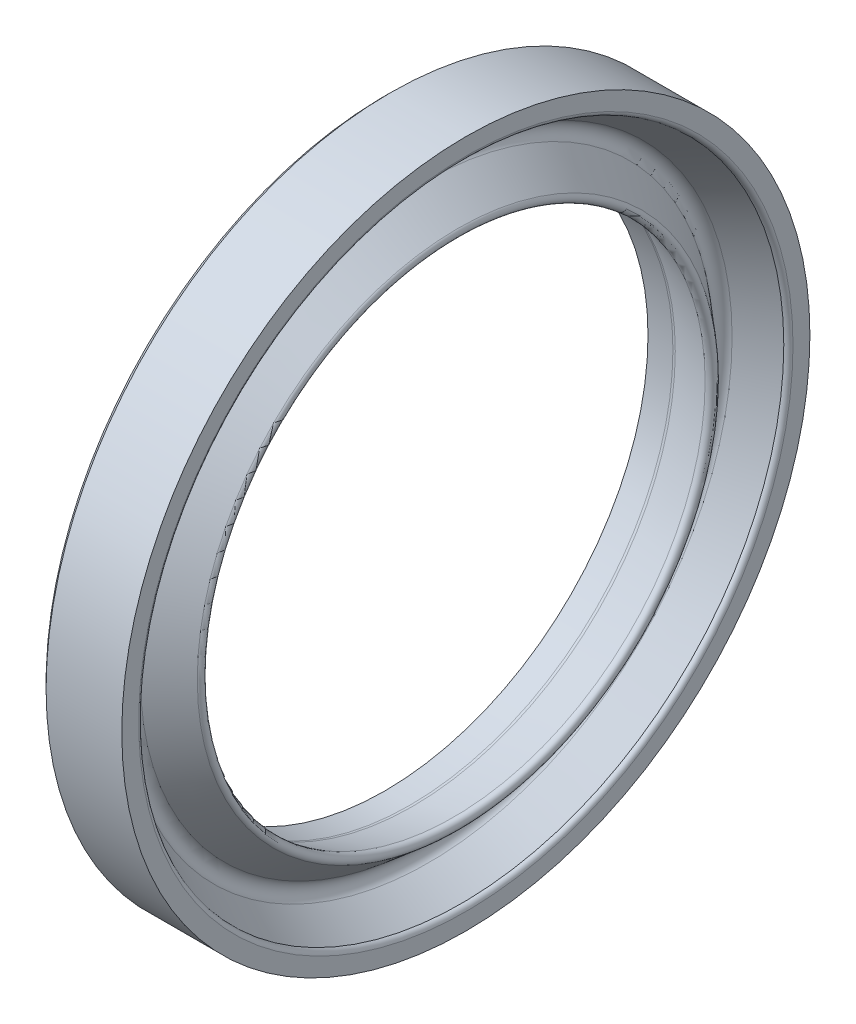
ISO-10303-21;
HEADER;
FILE_DESCRIPTION(('STEP AP214'),'2;1');
FILE_NAME('part.step','',(''),(''),'','','');
FILE_SCHEMA(('AUTOMOTIVE_DESIGN { 1 0 10303 214 1 1 1 1 }'));
ENDSEC;
DATA;
#1=APPLICATION_CONTEXT('core data for automotive mechanical design processes');
#2=APPLICATION_PROTOCOL_DEFINITION('international standard','automotive_design',2000,#1);
#3=PRODUCT_CONTEXT('',#1,'mechanical');
#4=PRODUCT('Part','Part','',(#3));
#5=PRODUCT_RELATED_PRODUCT_CATEGORY('part','',(#4));
#6=PRODUCT_DEFINITION_FORMATION('','',#4);
#7=PRODUCT_DEFINITION_CONTEXT('part definition',#1,'design');
#8=PRODUCT_DEFINITION('design','',#6,#7);
#9=PRODUCT_DEFINITION_SHAPE('','',#8);
#10=(LENGTH_UNIT() NAMED_UNIT(*) SI_UNIT(.MILLI.,.METRE.));
#11=(NAMED_UNIT(*) PLANE_ANGLE_UNIT() SI_UNIT($,.RADIAN.));
#12=(NAMED_UNIT(*) SI_UNIT($,.STERADIAN.) SOLID_ANGLE_UNIT());
#13=UNCERTAINTY_MEASURE_WITH_UNIT(LENGTH_MEASURE(1.E-05),#10,'distance_accuracy_value','');
#14=(GEOMETRIC_REPRESENTATION_CONTEXT(3) GLOBAL_UNCERTAINTY_ASSIGNED_CONTEXT((#13)) GLOBAL_UNIT_ASSIGNED_CONTEXT((#10,
#11,#12)) REPRESENTATION_CONTEXT('',''));
#15=CARTESIAN_POINT('',(0.,0.,0.));
#16=DIRECTION('',(0.,0.,1.));
#17=DIRECTION('',(1.,0.,0.));
#18=AXIS2_PLACEMENT_3D('',#15,#16,#17);
#19=CARTESIAN_POINT('',(-0.394634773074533,0.,0.));
#20=DIRECTION('',(1.,0.,0.));
#21=DIRECTION('',(0.,0.,-1.));
#22=AXIS2_PLACEMENT_3D('',#19,#20,#21);
#23=TOROIDAL_SURFACE('',#22,40.4953832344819,0.649999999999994);
#24=CARTESIAN_POINT('',(-0.324999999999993,0.,0.));
#25=DIRECTION('',(1.,0.,0.));
#26=DIRECTION('',(0.,0.,-1.));
#27=AXIS2_PLACEMENT_3D('',#24,#25,#26);
#28=CIRCLE('',#27,39.8491239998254);
#29=CARTESIAN_POINT('',(-0.324999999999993,0.,-39.8491239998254));
#30=VERTEX_POINT('',#29);
#31=EDGE_CURVE('E10',#30,#30,#28,.T.);
#32=ORIENTED_EDGE('',*,*,#31,.F.);
#33=EDGE_LOOP('',(#32));
#34=FACE_BOUND('',#33,.T.);
#35=CARTESIAN_POINT('',(0.249999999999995,0.,0.));
#36=DIRECTION('',(1.,0.,0.));
#37=DIRECTION('',(0.,0.,-1.));
#38=AXIS2_PLACEMENT_3D('',#35,#36,#37);
#39=CIRCLE('',#38,40.4120405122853);
#40=CARTESIAN_POINT('',(0.249999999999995,0.,-40.4120405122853));
#41=VERTEX_POINT('',#40);
#42=EDGE_CURVE('E70',#41,#41,#39,.T.);
#43=ORIENTED_EDGE('',*,*,#42,.T.);
#44=EDGE_LOOP('',(#43));
#45=FACE_BOUND('',#44,.T.);
#46=ADVANCED_FACE('F30',(#34,#45),#23,.T.);
#47=CARTESIAN_POINT('',(-0.324999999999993,0.,0.));
#48=DIRECTION('',(1.,0.,0.));
#49=DIRECTION('',(0.,0.,-1.));
#50=AXIS2_PLACEMENT_3D('',#47,#48,#49);
#51=CONICAL_SURFACE('',#50,39.8491239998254,0.5235987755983);
#52=CARTESIAN_POINT('',(-4.37410515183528,0.,0.));
#53=DIRECTION('',(1.,0.,0.));
#54=DIRECTION('',(0.,0.,-1.));
#55=AXIS2_PLACEMENT_3D('',#52,#53,#54);
#56=CIRCLE('',#55,37.5113720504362);
#57=CARTESIAN_POINT('',(-4.37410515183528,0.,-37.5113720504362));
#58=VERTEX_POINT('',#57);
#59=EDGE_CURVE('E36',#58,#58,#56,.T.);
#60=ORIENTED_EDGE('',*,*,#59,.F.);
#61=EDGE_LOOP('',(#60));
#62=FACE_BOUND('',#61,.T.);
#63=ORIENTED_EDGE('',*,*,#31,.T.);
#64=EDGE_LOOP('',(#63));
#65=FACE_BOUND('',#64,.T.);
#66=ADVANCED_FACE('F131',(#62,#65),#51,.F.);
#67=CARTESIAN_POINT('',(-3.72410515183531,0.,0.));
#68=DIRECTION('',(1.,0.,0.));
#69=DIRECTION('',(0.,0.,-1.));
#70=AXIS2_PLACEMENT_3D('',#67,#68,#69);
#71=TOROIDAL_SURFACE('',#70,36.3855390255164,1.29999999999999);
#72=CARTESIAN_POINT('',(-4.55972904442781,0.,0.));
#73=DIRECTION('',(1.,0.,0.));
#74=DIRECTION('',(0.,0.,-1.));
#75=AXIS2_PLACEMENT_3D('',#72,#73,#74);
#76=CIRCLE('',#75,35.3896812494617);
#77=CARTESIAN_POINT('',(-4.55972904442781,0.,-35.3896812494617));
#78=VERTEX_POINT('',#77);
#79=EDGE_CURVE('E40',#78,#78,#76,.T.);
#80=ORIENTED_EDGE('',*,*,#79,.F.);
#81=EDGE_LOOP('',(#80));
#82=FACE_BOUND('',#81,.T.);
#83=ORIENTED_EDGE('',*,*,#59,.T.);
#84=EDGE_LOOP('',(#83));
#85=FACE_BOUND('',#84,.T.);
#86=ADVANCED_FACE('F126',(#82,#85),#71,.F.);
#87=CARTESIAN_POINT('',(-4.55972904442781,0.,0.));
#88=DIRECTION('',(-1.,0.,0.));
#89=DIRECTION('',(0.,0.,1.));
#90=AXIS2_PLACEMENT_3D('',#87,#88,#89);
#91=CONICAL_SURFACE('',#90,35.3896812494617,0.698131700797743);
#92=CARTESIAN_POINT('',(-0.739226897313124,0.,0.));
#93=DIRECTION('',(1.,0.,0.));
#94=DIRECTION('',(0.,0.,-1.));
#95=AXIS2_PLACEMENT_3D('',#92,#93,#94);
#96=CIRCLE('',#95,32.1838993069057);
#97=CARTESIAN_POINT('',(-0.739226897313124,0.,-32.1838993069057));
#98=VERTEX_POINT('',#97);
#99=EDGE_CURVE('E44',#98,#98,#96,.T.);
#100=ORIENTED_EDGE('',*,*,#99,.F.);
#101=EDGE_LOOP('',(#100));
#102=FACE_BOUND('',#101,.T.);
#103=ORIENTED_EDGE('',*,*,#79,.T.);
#104=EDGE_LOOP('',(#103));
#105=FACE_BOUND('',#104,.T.);
#106=ADVANCED_FACE('F120',(#102,#105),#91,.T.);
#107=CARTESIAN_POINT('',(-1.13902208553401,0.,0.));
#108=DIRECTION('',(1.,0.,0.));
#109=DIRECTION('',(0.,0.,-1.));
#110=AXIS2_PLACEMENT_3D('',#107,#108,#109);
#111=TOROIDAL_SURFACE('',#110,31.7074419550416,0.621970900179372);
#112=CARTESIAN_POINT('',(-1.3,0.,0.));
#113=DIRECTION('',(1.,0.,0.));
#114=DIRECTION('',(0.,0.,-1.));
#115=AXIS2_PLACEMENT_3D('',#112,#113,#114);
#116=CIRCLE('',#115,31.1066641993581);
#117=CARTESIAN_POINT('',(-1.3,0.,-31.1066641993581));
#118=VERTEX_POINT('',#117);
#119=EDGE_CURVE('E49',#118,#118,#116,.T.);
#120=ORIENTED_EDGE('',*,*,#119,.F.);
#121=EDGE_LOOP('',(#120));
#122=FACE_BOUND('',#121,.T.);
#123=ORIENTED_EDGE('',*,*,#99,.T.);
#124=EDGE_LOOP('',(#123));
#125=FACE_BOUND('',#124,.T.);
#126=ADVANCED_FACE('F114',(#122,#125),#111,.T.);
#127=CARTESIAN_POINT('',(-1.3,0.,0.));
#128=DIRECTION('',(-1.,0.,0.));
#129=DIRECTION('',(0.,0.,1.));
#130=AXIS2_PLACEMENT_3D('',#127,#128,#129);
#131=CONICAL_SURFACE('',#130,31.1066641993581,0.261799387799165);
#132=CARTESIAN_POINT('',(-6.33468348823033,0.,0.));
#133=DIRECTION('',(1.,0.,0.));
#134=DIRECTION('',(0.,0.,-1.));
#135=AXIS2_PLACEMENT_3D('',#132,#133,#134);
#136=CIRCLE('',#135,32.4557035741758);
#137=CARTESIAN_POINT('',(-6.33468348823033,0.,-32.4557035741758));
#138=VERTEX_POINT('',#137);
#139=EDGE_CURVE('E52',#138,#138,#136,.T.);
#140=ORIENTED_EDGE('',*,*,#139,.F.);
#141=EDGE_LOOP('',(#140));
#142=FACE_BOUND('',#141,.T.);
#143=ORIENTED_EDGE('',*,*,#119,.T.);
#144=EDGE_LOOP('',(#143));
#145=FACE_BOUND('',#144,.T.);
#146=ADVANCED_FACE('F108',(#142,#145),#131,.F.);
#147=CARTESIAN_POINT('',(-6.67114824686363,0.,0.));
#148=DIRECTION('',(1.,0.,0.));
#149=DIRECTION('',(0.,0.,-1.));
#150=AXIS2_PLACEMENT_3D('',#147,#148,#149);
#151=TOROIDAL_SURFACE('',#150,31.2,1.3);
#152=CARTESIAN_POINT('',(-6.67114824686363,0.,0.));
#153=DIRECTION('',(1.,0.,0.));
#154=DIRECTION('',(0.,0.,-1.));
#155=AXIS2_PLACEMENT_3D('',#152,#153,#154);
#156=CIRCLE('',#155,32.5);
#157=CARTESIAN_POINT('',(-6.67114824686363,0.,-32.5));
#158=VERTEX_POINT('',#157);
#159=EDGE_CURVE('E55',#158,#158,#156,.T.);
#160=ORIENTED_EDGE('',*,*,#159,.F.);
#161=EDGE_LOOP('',(#160));
#162=FACE_BOUND('',#161,.T.);
#163=ORIENTED_EDGE('',*,*,#139,.T.);
#164=EDGE_LOOP('',(#163));
#165=FACE_BOUND('',#164,.T.);
#166=ADVANCED_FACE('F102',(#162,#165),#151,.F.);
#167=CARTESIAN_POINT('',(2.43404063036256,0.,0.));
#168=DIRECTION('',(1.,0.,0.));
#169=DIRECTION('',(0.,0.,-1.));
#170=AXIS2_PLACEMENT_3D('',#167,#168,#169);
#171=CYLINDRICAL_SURFACE('',#170,32.5);
#172=CARTESIAN_POINT('',(-9.75,0.,0.));
#173=DIRECTION('',(1.,0.,0.));
#174=DIRECTION('',(0.,0.,-1.));
#175=AXIS2_PLACEMENT_3D('',#172,#173,#174);
#176=CIRCLE('',#175,32.5);
#177=CARTESIAN_POINT('',(-9.75,0.,-32.5));
#178=VERTEX_POINT('',#177);
#179=EDGE_CURVE('E58',#178,#178,#176,.T.);
#180=ORIENTED_EDGE('',*,*,#179,.F.);
#181=EDGE_LOOP('',(#180));
#182=FACE_BOUND('',#181,.T.);
#183=ORIENTED_EDGE('',*,*,#159,.T.);
#184=EDGE_LOOP('',(#183));
#185=FACE_BOUND('',#184,.T.);
#186=ADVANCED_FACE('F96',(#182,#185),#171,.F.);
#187=CARTESIAN_POINT('',(-9.75,-41.85,0.));
#188=DIRECTION('',(1.,0.,0.));
#189=DIRECTION('',(0.,0.,-1.));
#190=AXIS2_PLACEMENT_3D('',#187,#188,#189);
#191=PLANE('',#190);
#192=CARTESIAN_POINT('',(-9.75,0.,0.));
#193=DIRECTION('',(1.,0.,0.));
#194=DIRECTION('',(0.,0.,-1.));
#195=AXIS2_PLACEMENT_3D('',#192,#193,#194);
#196=CIRCLE('',#195,41.85);
#197=CARTESIAN_POINT('',(-9.75,0.,-41.85));
#198=VERTEX_POINT('',#197);
#199=EDGE_CURVE('E61',#198,#198,#196,.T.);
#200=ORIENTED_EDGE('',*,*,#199,.F.);
#201=EDGE_LOOP('',(#200));
#202=FACE_BOUND('',#201,.T.);
#203=ORIENTED_EDGE('',*,*,#179,.T.);
#204=EDGE_LOOP('',(#203));
#205=FACE_BOUND('',#204,.T.);
#206=ADVANCED_FACE('F90',(#202,#205),#191,.F.);
#207=CARTESIAN_POINT('',(-9.75,0.,0.));
#208=DIRECTION('',(1.,0.,0.));
#209=DIRECTION('',(0.,0.,-1.));
#210=AXIS2_PLACEMENT_3D('',#207,#208,#209);
#211=CONICAL_SURFACE('',#210,41.85,0.78539816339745);
#212=CARTESIAN_POINT('',(-9.09999999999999,0.,0.));
#213=DIRECTION('',(1.,0.,0.));
#214=DIRECTION('',(0.,0.,-1.));
#215=AXIS2_PLACEMENT_3D('',#212,#213,#214);
#216=CIRCLE('',#215,42.5);
#217=CARTESIAN_POINT('',(-9.09999999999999,0.,-42.5));
#218=VERTEX_POINT('',#217);
#219=EDGE_CURVE('E64',#218,#218,#216,.T.);
#220=ORIENTED_EDGE('',*,*,#219,.F.);
#221=EDGE_LOOP('',(#220));
#222=FACE_BOUND('',#221,.T.);
#223=ORIENTED_EDGE('',*,*,#199,.T.);
#224=EDGE_LOOP('',(#223));
#225=FACE_BOUND('',#224,.T.);
#226=ADVANCED_FACE('F84',(#222,#225),#211,.T.);
#227=CARTESIAN_POINT('',(2.43404063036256,0.,0.));
#228=DIRECTION('',(1.,0.,0.));
#229=DIRECTION('',(0.,0.,-1.));
#230=AXIS2_PLACEMENT_3D('',#227,#228,#229);
#231=CYLINDRICAL_SURFACE('',#230,42.5);
#232=CARTESIAN_POINT('',(0.249999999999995,0.,0.));
#233=DIRECTION('',(1.,0.,0.));
#234=DIRECTION('',(0.,0.,-1.));
#235=AXIS2_PLACEMENT_3D('',#232,#233,#234);
#236=CIRCLE('',#235,42.5);
#237=CARTESIAN_POINT('',(0.249999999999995,0.,-42.5));
#238=VERTEX_POINT('',#237);
#239=EDGE_CURVE('E67',#238,#238,#236,.T.);
#240=ORIENTED_EDGE('',*,*,#239,.F.);
#241=EDGE_LOOP('',(#240));
#242=FACE_BOUND('',#241,.T.);
#243=ORIENTED_EDGE('',*,*,#219,.T.);
#244=EDGE_LOOP('',(#243));
#245=FACE_BOUND('',#244,.T.);
#246=ADVANCED_FACE('F78',(#242,#245),#231,.T.);
#247=CARTESIAN_POINT('',(0.249999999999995,-42.5,0.));
#248=DIRECTION('',(-1.,0.,0.));
#249=DIRECTION('',(0.,0.,1.));
#250=AXIS2_PLACEMENT_3D('',#247,#248,#249);
#251=PLANE('',#250);
#252=ORIENTED_EDGE('',*,*,#42,.F.);
#253=EDGE_LOOP('',(#252));
#254=FACE_BOUND('',#253,.T.);
#255=ORIENTED_EDGE('',*,*,#239,.T.);
#256=EDGE_LOOP('',(#255));
#257=FACE_BOUND('',#256,.T.);
#258=ADVANCED_FACE('F75',(#254,#257),#251,.F.);
#259=CLOSED_SHELL('',(#46,#66,#86,#106,#126,#146,#166,#186,#206,#226,#246,#258));
#260=MANIFOLD_SOLID_BREP('B2',#259);
#261=ADVANCED_BREP_SHAPE_REPRESENTATION('',(#18,#260),#14);
#262=SHAPE_DEFINITION_REPRESENTATION(#9,#261);
ENDSEC;
END-ISO-10303-21;
